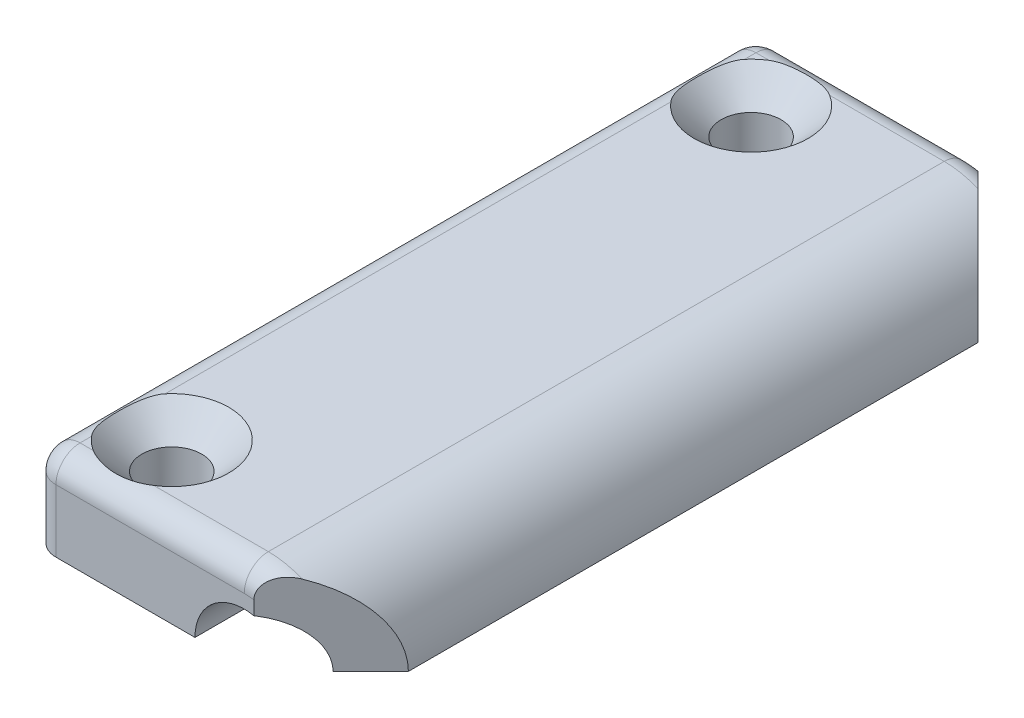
ISO-10303-21;
HEADER;
FILE_DESCRIPTION(('STEP AP214'),'2;1');
FILE_NAME('part.step','',(''),(''),'','','');
FILE_SCHEMA(('AUTOMOTIVE_DESIGN { 1 0 10303 214 1 1 1 1 }'));
ENDSEC;
DATA;
#1=APPLICATION_CONTEXT('core data for automotive mechanical design processes');
#2=APPLICATION_PROTOCOL_DEFINITION('international standard','automotive_design',2000,#1);
#3=PRODUCT_CONTEXT('',#1,'mechanical');
#4=PRODUCT('Part','Part','',(#3));
#5=PRODUCT_RELATED_PRODUCT_CATEGORY('part','',(#4));
#6=PRODUCT_DEFINITION_FORMATION('','',#4);
#7=PRODUCT_DEFINITION_CONTEXT('part definition',#1,'design');
#8=PRODUCT_DEFINITION('design','',#6,#7);
#9=PRODUCT_DEFINITION_SHAPE('','',#8);
#10=(LENGTH_UNIT() NAMED_UNIT(*) SI_UNIT(.MILLI.,.METRE.));
#11=(NAMED_UNIT(*) PLANE_ANGLE_UNIT() SI_UNIT($,.RADIAN.));
#12=(NAMED_UNIT(*) SI_UNIT($,.STERADIAN.) SOLID_ANGLE_UNIT());
#13=UNCERTAINTY_MEASURE_WITH_UNIT(LENGTH_MEASURE(1.E-05),#10,'distance_accuracy_value','');
#14=(GEOMETRIC_REPRESENTATION_CONTEXT(3) GLOBAL_UNCERTAINTY_ASSIGNED_CONTEXT((#13)) GLOBAL_UNIT_ASSIGNED_CONTEXT((#10,
#11,#12)) REPRESENTATION_CONTEXT('',''));
#15=CARTESIAN_POINT('',(0.,0.,0.));
#16=DIRECTION('',(0.,0.,1.));
#17=DIRECTION('',(1.,0.,0.));
#18=AXIS2_PLACEMENT_3D('',#15,#16,#17);
#19=CARTESIAN_POINT('',(7.,4.,15.));
#20=DIRECTION('',(0.,1.,0.));
#21=DIRECTION('',(0.,0.,1.));
#22=AXIS2_PLACEMENT_3D('',#19,#20,#21);
#23=PLANE('',#22);
#24=CARTESIAN_POINT('',(7.,4.,15.));
#25=DIRECTION('',(0.,-1.,0.));
#26=DIRECTION('',(0.,0.,-1.));
#27=AXIS2_PLACEMENT_3D('',#24,#25,#26);
#28=CIRCLE('',#27,3.1);
#29=CARTESIAN_POINT('',(7.,4.,11.9));
#30=VERTEX_POINT('',#29);
#31=EDGE_CURVE('E20',#30,#30,#28,.T.);
#32=ORIENTED_EDGE('',*,*,#31,.T.);
#33=EDGE_LOOP('',(#32));
#34=FACE_BOUND('',#33,.T.);
#35=ADVANCED_FACE('F17',(#34),#23,.F.);
#36=CARTESIAN_POINT('',(7.,4.,-15.));
#37=DIRECTION('',(0.,-1.,0.));
#38=DIRECTION('',(0.,0.,-1.));
#39=AXIS2_PLACEMENT_3D('',#36,#37,#38);
#40=PLANE('',#39);
#41=CARTESIAN_POINT('',(7.,4.,-15.));
#42=DIRECTION('',(0.,-1.,0.));
#43=DIRECTION('',(0.,0.,-1.));
#44=AXIS2_PLACEMENT_3D('',#41,#42,#43);
#45=CIRCLE('',#44,3.1);
#46=CARTESIAN_POINT('',(7.,4.,-18.1));
#47=VERTEX_POINT('',#46);
#48=EDGE_CURVE('E344',#47,#47,#45,.T.);
#49=ORIENTED_EDGE('',*,*,#48,.T.);
#50=EDGE_LOOP('',(#49));
#51=FACE_BOUND('',#50,.T.);
#52=ADVANCED_FACE('F356',(#51),#40,.T.);
#53=CARTESIAN_POINT('',(7.,4.,15.));
#54=DIRECTION('',(0.,-1.,0.));
#55=DIRECTION('',(0.,0.,-1.));
#56=AXIS2_PLACEMENT_3D('',#53,#54,#55);
#57=CYLINDRICAL_SURFACE('',#56,3.1);
#58=ORIENTED_EDGE('',*,*,#31,.F.);
#59=EDGE_LOOP('',(#58));
#60=FACE_BOUND('',#59,.T.);
#61=CARTESIAN_POINT('',(7.,0.,15.));
#62=DIRECTION('',(0.,-1.,0.));
#63=DIRECTION('',(0.,0.,-1.));
#64=AXIS2_PLACEMENT_3D('',#61,#62,#63);
#65=CIRCLE('',#64,3.1);
#66=CARTESIAN_POINT('',(7.,0.,11.9));
#67=VERTEX_POINT('',#66);
#68=EDGE_CURVE('E342',#67,#67,#65,.T.);
#69=ORIENTED_EDGE('',*,*,#68,.T.);
#70=EDGE_LOOP('',(#69));
#71=FACE_BOUND('',#70,.T.);
#72=ADVANCED_FACE('F352',(#60,#71),#57,.F.);
#73=CARTESIAN_POINT('',(7.,4.,-15.));
#74=DIRECTION('',(0.,-1.,0.));
#75=DIRECTION('',(0.,0.,-1.));
#76=AXIS2_PLACEMENT_3D('',#73,#74,#75);
#77=CYLINDRICAL_SURFACE('',#76,3.1);
#78=ORIENTED_EDGE('',*,*,#48,.F.);
#79=EDGE_LOOP('',(#78));
#80=FACE_BOUND('',#79,.T.);
#81=CARTESIAN_POINT('',(7.,0.,-15.));
#82=DIRECTION('',(0.,-1.,0.));
#83=DIRECTION('',(0.,0.,-1.));
#84=AXIS2_PLACEMENT_3D('',#81,#82,#83);
#85=CIRCLE('',#84,3.1);
#86=CARTESIAN_POINT('',(7.,0.,-18.1));
#87=VERTEX_POINT('',#86);
#88=EDGE_CURVE('E145',#87,#87,#85,.T.);
#89=ORIENTED_EDGE('',*,*,#88,.T.);
#90=EDGE_LOOP('',(#89));
#91=FACE_BOUND('',#90,.T.);
#92=ADVANCED_FACE('F355',(#80,#91),#77,.F.);
#93=CARTESIAN_POINT('',(2.5,0.,-35.));
#94=DIRECTION('',(0.,-1.,0.));
#95=DIRECTION('',(0.,0.,-1.));
#96=AXIS2_PLACEMENT_3D('',#93,#94,#95);
#97=CYLINDRICAL_SURFACE('',#96,2.5);
#98=CARTESIAN_POINT('',(2.5,6.50000000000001,-35.));
#99=DIRECTION('',(0.,1.,0.));
#100=DIRECTION('',(1.,0.,0.));
#101=AXIS2_PLACEMENT_3D('',#98,#99,#100);
#102=CIRCLE('',#101,2.5);
#103=CARTESIAN_POINT('',(2.5,6.50000000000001,-37.5));
#104=VERTEX_POINT('',#103);
#105=CARTESIAN_POINT('',(0.,6.50000000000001,-35.));
#106=VERTEX_POINT('',#105);
#107=EDGE_CURVE('E159',#104,#106,#102,.T.);
#108=ORIENTED_EDGE('',*,*,#107,.F.);
#109=DIRECTION('',(0.,1.,0.));
#110=VECTOR('',#109,1.);
#111=CARTESIAN_POINT('',(2.5,0.,-37.5));
#112=LINE('',#111,#110);
#113=CARTESIAN_POINT('',(2.5,0.,-37.5));
#114=VERTEX_POINT('',#113);
#115=EDGE_CURVE('E151',#104,#114,#112,.F.);
#116=ORIENTED_EDGE('',*,*,#115,.T.);
#117=CARTESIAN_POINT('',(2.5,0.,-35.));
#118=DIRECTION('',(0.,-1.,0.));
#119=DIRECTION('',(0.,0.,-1.));
#120=AXIS2_PLACEMENT_3D('',#117,#118,#119);
#121=CIRCLE('',#120,2.5);
#122=CARTESIAN_POINT('',(0.,0.,-35.));
#123=VERTEX_POINT('',#122);
#124=EDGE_CURVE('E133',#114,#123,#121,.F.);
#125=ORIENTED_EDGE('',*,*,#124,.T.);
#126=DIRECTION('',(0.,1.,0.));
#127=VECTOR('',#126,1.);
#128=CARTESIAN_POINT('',(0.,0.,-35.));
#129=LINE('',#128,#127);
#130=EDGE_CURVE('E222',#123,#106,#129,.T.);
#131=ORIENTED_EDGE('',*,*,#130,.T.);
#132=EDGE_LOOP('',(#108,#116,#125,#131));
#133=FACE_BOUND('',#132,.T.);
#134=ADVANCED_FACE('F158',(#133),#97,.T.);
#135=CARTESIAN_POINT('',(0.,0.,37.5));
#136=DIRECTION('',(0.,1.,0.));
#137=DIRECTION('',(0.,0.,1.));
#138=AXIS2_PLACEMENT_3D('',#135,#136,#137);
#139=PLANE('',#138);
#140=CARTESIAN_POINT('',(2.5,0.,35.));
#141=DIRECTION('',(0.,1.,0.));
#142=DIRECTION('',(0.,0.,1.));
#143=AXIS2_PLACEMENT_3D('',#140,#141,#142);
#144=CIRCLE('',#143,2.5);
#145=CARTESIAN_POINT('',(0.,0.,35.));
#146=VERTEX_POINT('',#145);
#147=CARTESIAN_POINT('',(2.5,0.,37.5));
#148=VERTEX_POINT('',#147);
#149=EDGE_CURVE('E211',#146,#148,#144,.T.);
#150=ORIENTED_EDGE('',*,*,#149,.F.);
#151=DIRECTION('',(0.,0.,-1.));
#152=VECTOR('',#151,1.);
#153=CARTESIAN_POINT('',(0.,0.,37.5));
#154=LINE('',#153,#152);
#155=EDGE_CURVE('E140',#146,#123,#154,.T.);
#156=ORIENTED_EDGE('',*,*,#155,.T.);
#157=ORIENTED_EDGE('',*,*,#124,.F.);
#158=DIRECTION('',(1.,0.,0.));
#159=VECTOR('',#158,1.);
#160=CARTESIAN_POINT('',(22.,0.,-37.5));
#161=LINE('',#160,#159);
#162=CARTESIAN_POINT('',(16.9,0.,-37.5));
#163=VERTEX_POINT('',#162);
#164=EDGE_CURVE('E138',#114,#163,#161,.T.);
#165=ORIENTED_EDGE('',*,*,#164,.T.);
#166=DIRECTION('',(0.,0.,-1.));
#167=VECTOR('',#166,1.);
#168=CARTESIAN_POINT('',(16.9,0.,37.5));
#169=LINE('',#168,#167);
#170=CARTESIAN_POINT('',(16.9,0.,37.5));
#171=VERTEX_POINT('',#170);
#172=EDGE_CURVE('E144',#163,#171,#169,.F.);
#173=ORIENTED_EDGE('',*,*,#172,.T.);
#174=DIRECTION('',(1.,0.,0.));
#175=VECTOR('',#174,1.);
#176=CARTESIAN_POINT('',(22.,0.,37.5));
#177=LINE('',#176,#175);
#178=EDGE_CURVE('E274',#148,#171,#177,.T.);
#179=ORIENTED_EDGE('',*,*,#178,.F.);
#180=EDGE_LOOP('',(#150,#156,#157,#165,#173,#179));
#181=FACE_BOUND('',#180,.T.);
#182=CARTESIAN_POINT('',(7.,0.,-30.));
#183=DIRECTION('',(0.,1.,0.));
#184=DIRECTION('',(0.,0.,1.));
#185=AXIS2_PLACEMENT_3D('',#182,#183,#184);
#186=CIRCLE('',#185,3.1);
#187=CARTESIAN_POINT('',(7.,0.,-26.9));
#188=VERTEX_POINT('',#187);
#189=EDGE_CURVE('E161',#188,#188,#186,.T.);
#190=ORIENTED_EDGE('',*,*,#189,.T.);
#191=EDGE_LOOP('',(#190));
#192=FACE_BOUND('',#191,.T.);
#193=CARTESIAN_POINT('',(7.,0.,30.));
#194=DIRECTION('',(0.,1.,0.));
#195=DIRECTION('',(0.,0.,1.));
#196=AXIS2_PLACEMENT_3D('',#193,#194,#195);
#197=CIRCLE('',#196,3.1);
#198=CARTESIAN_POINT('',(7.,0.,33.1));
#199=VERTEX_POINT('',#198);
#200=EDGE_CURVE('E205',#199,#199,#197,.T.);
#201=ORIENTED_EDGE('',*,*,#200,.T.);
#202=EDGE_LOOP('',(#201));
#203=FACE_BOUND('',#202,.T.);
#204=ORIENTED_EDGE('',*,*,#88,.F.);
#205=EDGE_LOOP('',(#204));
#206=FACE_BOUND('',#205,.T.);
#207=ORIENTED_EDGE('',*,*,#68,.F.);
#208=EDGE_LOOP('',(#207));
#209=FACE_BOUND('',#208,.T.);
#210=ADVANCED_FACE('F135',(#181,#192,#203,#206,#209),#139,.F.);
#211=CARTESIAN_POINT('',(22.,0.,37.5));
#212=DIRECTION('',(0.,0.,-1.));
#213=DIRECTION('',(-1.,0.,0.));
#214=AXIS2_PLACEMENT_3D('',#211,#212,#213);
#215=CYLINDRICAL_SURFACE('',#214,5.1);
#216=CARTESIAN_POINT('',(22.,0.,38.5));
#217=DIRECTION('',(-0.707106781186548,0.,-0.707106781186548));
#218=DIRECTION('',(0.707106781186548,0.,-0.707106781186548));
#219=AXIS2_PLACEMENT_3D('',#216,#217,#218);
#220=ELLIPSE('',#219,7.21248916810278,5.1);
#221=CARTESIAN_POINT('',(27.1,0.,33.4));
#222=VERTEX_POINT('',#221);
#223=CARTESIAN_POINT('',(23.,5.00099990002,37.5));
#224=VERTEX_POINT('',#223);
#225=EDGE_CURVE('E173',#222,#224,#220,.F.);
#226=ORIENTED_EDGE('',*,*,#225,.T.);
#227=CARTESIAN_POINT('',(22.,0.,37.5));
#228=DIRECTION('',(0.,0.,-1.));
#229=DIRECTION('',(-1.,0.,0.));
#230=AXIS2_PLACEMENT_3D('',#227,#228,#229);
#231=CIRCLE('',#230,5.1);
#232=EDGE_CURVE('E281',#171,#224,#231,.T.);
#233=ORIENTED_EDGE('',*,*,#232,.F.);
#234=ORIENTED_EDGE('',*,*,#172,.F.);
#235=CARTESIAN_POINT('',(22.,0.,-37.5));
#236=DIRECTION('',(0.,0.,-1.));
#237=DIRECTION('',(-1.,0.,0.));
#238=AXIS2_PLACEMENT_3D('',#235,#236,#237);
#239=CIRCLE('',#238,5.1);
#240=CARTESIAN_POINT('',(23.,5.00099990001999,-37.5));
#241=VERTEX_POINT('',#240);
#242=EDGE_CURVE('E155',#163,#241,#239,.T.);
#243=ORIENTED_EDGE('',*,*,#242,.T.);
#244=CARTESIAN_POINT('',(22.,0.,-38.5));
#245=DIRECTION('',(0.707106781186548,0.,-0.707106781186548));
#246=DIRECTION('',(-0.707106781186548,0.,-0.707106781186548));
#247=AXIS2_PLACEMENT_3D('',#244,#245,#246);
#248=ELLIPSE('',#247,7.21248916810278,5.1);
#249=CARTESIAN_POINT('',(27.1,0.,-33.4));
#250=VERTEX_POINT('',#249);
#251=EDGE_CURVE('E330',#250,#241,#248,.F.);
#252=ORIENTED_EDGE('',*,*,#251,.F.);
#253=DIRECTION('',(0.,0.,1.));
#254=VECTOR('',#253,1.);
#255=CARTESIAN_POINT('',(27.1,0.,37.5));
#256=LINE('',#255,#254);
#257=EDGE_CURVE('E335',#250,#222,#256,.T.);
#258=ORIENTED_EDGE('',*,*,#257,.T.);
#259=EDGE_LOOP('',(#226,#233,#234,#243,#252,#258));
#260=FACE_BOUND('',#259,.T.);
#261=ADVANCED_FACE('F361',(#260),#215,.F.);
#262=CARTESIAN_POINT('',(2.5,0.,35.));
#263=DIRECTION('',(0.,1.,0.));
#264=DIRECTION('',(0.,0.,1.));
#265=AXIS2_PLACEMENT_3D('',#262,#263,#264);
#266=CYLINDRICAL_SURFACE('',#265,2.5);
#267=CARTESIAN_POINT('',(2.5,6.5,35.));
#268=DIRECTION('',(0.,-1.,0.));
#269=DIRECTION('',(1.,0.,0.));
#270=AXIS2_PLACEMENT_3D('',#267,#268,#269);
#271=CIRCLE('',#270,2.5);
#272=CARTESIAN_POINT('',(0.,6.5,35.));
#273=VERTEX_POINT('',#272);
#274=CARTESIAN_POINT('',(2.5,6.50000000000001,37.5));
#275=VERTEX_POINT('',#274);
#276=EDGE_CURVE('E299',#273,#275,#271,.F.);
#277=ORIENTED_EDGE('',*,*,#276,.F.);
#278=DIRECTION('',(0.,1.,0.));
#279=VECTOR('',#278,1.);
#280=CARTESIAN_POINT('',(0.,0.,35.));
#281=LINE('',#280,#279);
#282=EDGE_CURVE('E219',#273,#146,#281,.F.);
#283=ORIENTED_EDGE('',*,*,#282,.T.);
#284=ORIENTED_EDGE('',*,*,#149,.T.);
#285=DIRECTION('',(0.,1.,0.));
#286=VECTOR('',#285,1.);
#287=CARTESIAN_POINT('',(2.5,0.,37.5));
#288=LINE('',#287,#286);
#289=EDGE_CURVE('E282',#275,#148,#288,.F.);
#290=ORIENTED_EDGE('',*,*,#289,.F.);
#291=EDGE_LOOP('',(#277,#283,#284,#290));
#292=FACE_BOUND('',#291,.T.);
#293=ADVANCED_FACE('F368',(#292),#266,.T.);
#294=CARTESIAN_POINT('',(0.,9.00000000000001,37.5));
#295=DIRECTION('',(0.,-1.,0.));
#296=DIRECTION('',(0.,0.,-1.));
#297=AXIS2_PLACEMENT_3D('',#294,#295,#296);
#298=PLANE('',#297);
#299=DIRECTION('',(0.,0.,-1.));
#300=VECTOR('',#299,1.);
#301=CARTESIAN_POINT('',(2.5,9.00000000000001,37.5));
#302=LINE('',#301,#300);
#303=CARTESIAN_POINT('',(2.5,9.00000000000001,35.));
#304=VERTEX_POINT('',#303);
#305=CARTESIAN_POINT('',(2.5,8.99999999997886,33.8157568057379));
#306=VERTEX_POINT('',#305);
#307=EDGE_CURVE('E203',#304,#306,#302,.T.);
#308=ORIENTED_EDGE('',*,*,#307,.F.);
#309=DIRECTION('',(1.,0.,0.));
#310=VECTOR('',#309,1.);
#311=CARTESIAN_POINT('',(0.,9.00000000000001,35.));
#312=LINE('',#311,#310);
#313=CARTESIAN_POINT('',(3.86790804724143,8.99999999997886,35.));
#314=VERTEX_POINT('',#313);
#315=EDGE_CURVE('E206',#314,#304,#312,.F.);
#316=ORIENTED_EDGE('',*,*,#315,.F.);
#317=CARTESIAN_POINT('',(7.,8.99999999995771,30.));
#318=DIRECTION('',(0.,1.,0.));
#319=DIRECTION('',(0.,0.,1.));
#320=AXIS2_PLACEMENT_3D('',#317,#318,#319);
#321=CIRCLE('',#320,5.90000000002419);
#322=EDGE_CURVE('E202',#314,#306,#321,.F.);
#323=ORIENTED_EDGE('',*,*,#322,.T.);
#324=EDGE_LOOP('',(#308,#316,#323));
#325=FACE_BOUND('',#324,.T.);
#326=ADVANCED_FACE('F550',(#325),#298,.F.);
#327=CARTESIAN_POINT('',(7.,0.,30.));
#328=DIRECTION('',(0.,1.,0.));
#329=DIRECTION('',(0.,0.,1.));
#330=AXIS2_PLACEMENT_3D('',#327,#328,#329);
#331=CYLINDRICAL_SURFACE('',#330,3.1);
#332=CARTESIAN_POINT('',(7.,6.19999999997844,30.));
#333=DIRECTION('',(0.,1.,0.));
#334=DIRECTION('',(0.,0.,-1.));
#335=AXIS2_PLACEMENT_3D('',#332,#333,#334);
#336=CIRCLE('',#335,3.10000000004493);
#337=CARTESIAN_POINT('',(7.,6.19999999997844,26.8999999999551));
#338=VERTEX_POINT('',#337);
#339=EDGE_CURVE('E199',#338,#338,#336,.T.);
#340=ORIENTED_EDGE('',*,*,#339,.T.);
#341=EDGE_LOOP('',(#340));
#342=FACE_BOUND('',#341,.T.);
#343=ORIENTED_EDGE('',*,*,#200,.F.);
#344=EDGE_LOOP('',(#343));
#345=FACE_BOUND('',#344,.T.);
#346=ADVANCED_FACE('F606',(#342,#345),#331,.F.);
#347=CARTESIAN_POINT('',(0.,0.,37.5));
#348=DIRECTION('',(1.,0.,0.));
#349=DIRECTION('',(0.,0.,-1.));
#350=AXIS2_PLACEMENT_3D('',#347,#348,#349);
#351=PLANE('',#350);
#352=ORIENTED_EDGE('',*,*,#282,.F.);
#353=DIRECTION('',(0.,0.,-1.));
#354=VECTOR('',#353,1.);
#355=CARTESIAN_POINT('',(0.,6.50000000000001,37.5));
#356=LINE('',#355,#354);
#357=EDGE_CURVE('E195',#106,#273,#356,.F.);
#358=ORIENTED_EDGE('',*,*,#357,.F.);
#359=ORIENTED_EDGE('',*,*,#130,.F.);
#360=ORIENTED_EDGE('',*,*,#155,.F.);
#361=EDGE_LOOP('',(#352,#358,#359,#360));
#362=FACE_BOUND('',#361,.T.);
#363=ADVANCED_FACE('F599',(#362),#351,.F.);
#364=CARTESIAN_POINT('',(0.,9.00000000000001,37.5));
#365=DIRECTION('',(0.,-1.,0.));
#366=DIRECTION('',(0.,0.,-1.));
#367=AXIS2_PLACEMENT_3D('',#364,#365,#366);
#368=PLANE('',#367);
#369=DIRECTION('',(0.,0.,-1.));
#370=VECTOR('',#369,1.);
#371=CARTESIAN_POINT('',(2.5,9.00000000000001,37.5));
#372=LINE('',#371,#370);
#373=CARTESIAN_POINT('',(2.5,8.99999999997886,-33.8157568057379));
#374=VERTEX_POINT('',#373);
#375=CARTESIAN_POINT('',(2.5,9.00000000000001,-34.9999999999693));
#376=VERTEX_POINT('',#375);
#377=EDGE_CURVE('E196',#374,#376,#372,.T.);
#378=ORIENTED_EDGE('',*,*,#377,.F.);
#379=CARTESIAN_POINT('',(7.,8.99999999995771,-30.));
#380=DIRECTION('',(0.,1.,0.));
#381=DIRECTION('',(0.,0.,1.));
#382=AXIS2_PLACEMENT_3D('',#379,#380,#381);
#383=CIRCLE('',#382,5.90000000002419);
#384=CARTESIAN_POINT('',(3.86790804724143,8.99999999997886,-35.));
#385=VERTEX_POINT('',#384);
#386=EDGE_CURVE('E187',#374,#385,#383,.F.);
#387=ORIENTED_EDGE('',*,*,#386,.T.);
#388=DIRECTION('',(1.,0.,0.));
#389=VECTOR('',#388,1.);
#390=CARTESIAN_POINT('',(0.,9.00000000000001,-35.));
#391=LINE('',#390,#389);
#392=EDGE_CURVE('E164',#376,#385,#391,.T.);
#393=ORIENTED_EDGE('',*,*,#392,.F.);
#394=EDGE_LOOP('',(#378,#387,#393));
#395=FACE_BOUND('',#394,.T.);
#396=ADVANCED_FACE('F479',(#395),#368,.F.);
#397=CARTESIAN_POINT('',(7.,0.,-30.));
#398=DIRECTION('',(0.,1.,0.));
#399=DIRECTION('',(0.,0.,1.));
#400=AXIS2_PLACEMENT_3D('',#397,#398,#399);
#401=CYLINDRICAL_SURFACE('',#400,3.1);
#402=ORIENTED_EDGE('',*,*,#189,.F.);
#403=EDGE_LOOP('',(#402));
#404=FACE_BOUND('',#403,.T.);
#405=CARTESIAN_POINT('',(7.,6.19999999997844,-30.));
#406=DIRECTION('',(0.,1.,0.));
#407=DIRECTION('',(0.,0.,1.));
#408=AXIS2_PLACEMENT_3D('',#405,#406,#407);
#409=CIRCLE('',#408,3.10000000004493);
#410=CARTESIAN_POINT('',(7.,6.19999999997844,-26.8999999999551));
#411=VERTEX_POINT('',#410);
#412=EDGE_CURVE('E183',#411,#411,#409,.T.);
#413=ORIENTED_EDGE('',*,*,#412,.T.);
#414=EDGE_LOOP('',(#413));
#415=FACE_BOUND('',#414,.T.);
#416=ADVANCED_FACE('F587',(#404,#415),#401,.F.);
#417=CARTESIAN_POINT('',(22.,0.,-37.5));
#418=DIRECTION('',(0.,0.,1.));
#419=DIRECTION('',(1.,0.,0.));
#420=AXIS2_PLACEMENT_3D('',#417,#418,#419);
#421=PLANE('',#420);
#422=ORIENTED_EDGE('',*,*,#242,.F.);
#423=ORIENTED_EDGE('',*,*,#164,.F.);
#424=ORIENTED_EDGE('',*,*,#115,.F.);
#425=DIRECTION('',(-1.,0.,0.));
#426=VECTOR('',#425,1.);
#427=CARTESIAN_POINT('',(0.,6.50000000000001,-37.5));
#428=LINE('',#427,#426);
#429=CARTESIAN_POINT('',(22.,6.50000000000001,-37.5));
#430=VERTEX_POINT('',#429);
#431=EDGE_CURVE('E180',#430,#104,#428,.T.);
#432=ORIENTED_EDGE('',*,*,#431,.F.);
#433=CARTESIAN_POINT('',(22.,0.,-37.5));
#434=DIRECTION('',(0.,0.,1.));
#435=DIRECTION('',(0.153846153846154,0.988094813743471,0.));
#436=AXIS2_PLACEMENT_3D('',#433,#434,#435);
#437=CIRCLE('',#436,6.5);
#438=CARTESIAN_POINT('',(23.,6.42261628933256,-37.5));
#439=VERTEX_POINT('',#438);
#440=EDGE_CURVE('E285',#439,#430,#437,.T.);
#441=ORIENTED_EDGE('',*,*,#440,.F.);
#442=DIRECTION('',(0.,1.,0.));
#443=VECTOR('',#442,1.);
#444=CARTESIAN_POINT('',(23.,20.3137084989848,-37.5));
#445=LINE('',#444,#443);
#446=EDGE_CURVE('E332',#241,#439,#445,.T.);
#447=ORIENTED_EDGE('',*,*,#446,.F.);
#448=EDGE_LOOP('',(#422,#423,#424,#432,#441,#447));
#449=FACE_BOUND('',#448,.T.);
#450=ADVANCED_FACE('F149',(#449),#421,.F.);
#451=CARTESIAN_POINT('',(2.5,6.50000000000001,-35.));
#452=DIRECTION('',(1.,0.,0.));
#453=DIRECTION('',(0.,0.,-1.));
#454=AXIS2_PLACEMENT_3D('',#451,#452,#453);
#455=SPHERICAL_SURFACE('',#454,2.5);
#456=ORIENTED_EDGE('',*,*,#107,.T.);
#457=CARTESIAN_POINT('',(2.5,6.50000000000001,-35.));
#458=DIRECTION('',(0.,0.,-1.));
#459=DIRECTION('',(-1.,0.,0.));
#460=AXIS2_PLACEMENT_3D('',#457,#458,#459);
#461=CIRCLE('',#460,2.5);
#462=EDGE_CURVE('E192',#376,#106,#461,.F.);
#463=ORIENTED_EDGE('',*,*,#462,.F.);
#464=CARTESIAN_POINT('',(2.5,6.50000000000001,-35.));
#465=DIRECTION('',(-1.,0.,0.));
#466=DIRECTION('',(0.,0.,1.));
#467=AXIS2_PLACEMENT_3D('',#464,#465,#466);
#468=CIRCLE('',#467,2.5);
#469=EDGE_CURVE('E176',#104,#376,#468,.F.);
#470=ORIENTED_EDGE('',*,*,#469,.F.);
#471=EDGE_LOOP('',(#456,#463,#470));
#472=FACE_BOUND('',#471,.T.);
#473=ADVANCED_FACE('F435',(#472),#455,.T.);
#474=CARTESIAN_POINT('',(23.,20.3137084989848,37.5));
#475=DIRECTION('',(-0.707106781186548,0.,-0.707106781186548));
#476=DIRECTION('',(-0.707106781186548,0.,0.707106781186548));
#477=AXIS2_PLACEMENT_3D('',#474,#475,#476);
#478=PLANE('',#477);
#479=CARTESIAN_POINT('',(22.,0.,38.5));
#480=DIRECTION('',(-0.707106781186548,0.,-0.707106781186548));
#481=DIRECTION('',(0.707106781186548,0.,-0.707106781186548));
#482=AXIS2_PLACEMENT_3D('',#479,#480,#481);
#483=ELLIPSE('',#482,12.7279220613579,9.);
#484=CARTESIAN_POINT('',(25.5,8.2915619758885,35.));
#485=VERTEX_POINT('',#484);
#486=CARTESIAN_POINT('',(31.,0.,29.5));
#487=VERTEX_POINT('',#486);
#488=EDGE_CURVE('E486',#485,#487,#483,.T.);
#489=ORIENTED_EDGE('',*,*,#488,.F.);
#490=CARTESIAN_POINT('',(23.,6.42261628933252,37.5));
#491=CARTESIAN_POINT('',(22.9999889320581,6.4741114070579,37.5000110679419));
#492=CARTESIAN_POINT('',(23.001553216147,6.52561094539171,37.498446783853));
#493=CARTESIAN_POINT('',(23.0078451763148,6.62821871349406,37.4921548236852));
#494=CARTESIAN_POINT('',(23.012572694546,6.67932696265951,37.487427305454));
#495=CARTESIAN_POINT('',(23.0251768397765,6.78054066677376,37.4748231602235));
#496=CARTESIAN_POINT('',(23.033039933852,6.8306494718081,37.466960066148));
#497=CARTESIAN_POINT('',(23.0518390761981,6.92968262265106,37.4481609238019));
#498=CARTESIAN_POINT('',(23.0627749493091,6.97860703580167,37.4372250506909));
#499=CARTESIAN_POINT('',(23.1000476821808,7.12310149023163,37.3999523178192));
#500=CARTESIAN_POINT('',(23.1308558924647,7.21644213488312,37.3691441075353));
#501=CARTESIAN_POINT('',(23.2029348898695,7.39458963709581,37.2970651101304));
#502=CARTESIAN_POINT('',(23.2442118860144,7.47939138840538,37.2557881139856));
#503=CARTESIAN_POINT('',(23.3362001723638,7.64020788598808,37.1637998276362));
#504=CARTESIAN_POINT('',(23.3870486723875,7.71606480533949,37.1129513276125));
#505=CARTESIAN_POINT('',(23.4959321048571,7.85659814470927,37.0040678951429));
#506=CARTESIAN_POINT('',(23.5539702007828,7.92126961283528,36.9460297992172));
#507=CARTESIAN_POINT('',(23.6851251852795,8.04836759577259,36.8148748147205));
#508=CARTESIAN_POINT('',(23.7591798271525,8.10885451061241,36.7408201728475));
#509=CARTESIAN_POINT('',(23.9125130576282,8.21456574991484,36.5874869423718));
#510=CARTESIAN_POINT('',(23.9917939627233,8.25978325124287,36.5082060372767));
#511=CARTESIAN_POINT('',(24.169120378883,8.34256919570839,36.330879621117));
#512=CARTESIAN_POINT('',(24.2678800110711,8.37707587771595,36.2321199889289));
#513=CARTESIAN_POINT('',(24.4678525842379,8.42625634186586,36.0321474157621));
#514=CARTESIAN_POINT('',(24.5690677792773,8.4409111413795,35.9309322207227));
#515=CARTESIAN_POINT('',(24.7913994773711,8.4526248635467,35.7086005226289));
#516=CARTESIAN_POINT('',(24.9126174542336,8.44577941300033,35.5873825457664));
#517=CARTESIAN_POINT('',(25.1529856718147,8.40785918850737,35.3470143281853));
#518=CARTESIAN_POINT('',(25.2721376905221,8.37680642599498,35.2278623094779));
#519=CARTESIAN_POINT('',(25.4263715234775,8.3214788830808,35.0736284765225));
#520=CARTESIAN_POINT('',(25.4633067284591,8.30705301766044,35.0366932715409));
#521=CARTESIAN_POINT('',(25.5,8.2915619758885,35.));
#522=B_SPLINE_CURVE_WITH_KNOTS('',3,(#490,#491,#492,#493,#494,#495,#496,#497,#498,#499,#500,
#501,#502,#503,#504,#505,#506,#507,#508,#509,#510,#511,#512,#513,#514,#515,#516,#517,#518,#519,
#520,#521),.UNSPECIFIED.,.F.,.F.,(4,2,2,2,2,2,2,2,2,2,2,2,2,2,2,4),(0.,0.154442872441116,
0.308878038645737,0.462653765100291,0.616420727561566,0.923806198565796,1.23137440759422,
1.54374370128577,1.85625093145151,2.21772547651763,2.57936133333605,3.00935915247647,
3.43976785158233,3.95255045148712,4.46486732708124,4.6273795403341),.UNSPECIFIED.);
#523=CARTESIAN_POINT('',(23.,6.42261628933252,37.5));
#524=VERTEX_POINT('',#523);
#525=EDGE_CURVE('E422',#524,#485,#522,.T.);
#526=ORIENTED_EDGE('',*,*,#525,.F.);
#527=DIRECTION('',(0.,1.,0.));
#528=VECTOR('',#527,1.);
#529=CARTESIAN_POINT('',(23.,0.,37.5));
#530=LINE('',#529,#528);
#531=EDGE_CURVE('E283',#224,#524,#530,.T.);
#532=ORIENTED_EDGE('',*,*,#531,.F.);
#533=ORIENTED_EDGE('',*,*,#225,.F.);
#534=DIRECTION('',(0.707106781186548,0.,-0.707106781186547));
#535=VECTOR('',#534,1.);
#536=CARTESIAN_POINT('',(27.1,0.,33.4));
#537=LINE('',#536,#535);
#538=EDGE_CURVE('E333',#222,#487,#537,.T.);
#539=ORIENTED_EDGE('',*,*,#538,.T.);
#540=EDGE_LOOP('',(#489,#526,#532,#533,#539));
#541=FACE_BOUND('',#540,.T.);
#542=ADVANCED_FACE('F430',(#541),#478,.F.);
#543=CARTESIAN_POINT('',(27.1,0.,37.5));
#544=DIRECTION('',(0.,1.,0.));
#545=DIRECTION('',(-1.,0.,0.));
#546=AXIS2_PLACEMENT_3D('',#543,#544,#545);
#547=PLANE('',#546);
#548=ORIENTED_EDGE('',*,*,#538,.F.);
#549=ORIENTED_EDGE('',*,*,#257,.F.);
#550=DIRECTION('',(-0.707106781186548,0.,-0.707106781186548));
#551=VECTOR('',#550,1.);
#552=CARTESIAN_POINT('',(23.,0.,-37.5));
#553=LINE('',#552,#551);
#554=CARTESIAN_POINT('',(31.,0.,-29.5));
#555=VERTEX_POINT('',#554);
#556=EDGE_CURVE('E305',#555,#250,#553,.T.);
#557=ORIENTED_EDGE('',*,*,#556,.F.);
#558=DIRECTION('',(0.,0.,-1.));
#559=VECTOR('',#558,1.);
#560=CARTESIAN_POINT('',(31.,0.,37.5));
#561=LINE('',#560,#559);
#562=EDGE_CURVE('E463',#487,#555,#561,.T.);
#563=ORIENTED_EDGE('',*,*,#562,.F.);
#564=EDGE_LOOP('',(#548,#549,#557,#563));
#565=FACE_BOUND('',#564,.T.);
#566=ADVANCED_FACE('F434',(#565),#547,.F.);
#567=CARTESIAN_POINT('',(23.,20.3137084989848,-37.5));
#568=DIRECTION('',(0.707106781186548,0.,-0.707106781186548));
#569=DIRECTION('',(-0.707106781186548,0.,-0.707106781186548));
#570=AXIS2_PLACEMENT_3D('',#567,#568,#569);
#571=PLANE('',#570);
#572=CARTESIAN_POINT('',(22.,0.,-38.5));
#573=DIRECTION('',(0.707106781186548,0.,-0.707106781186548));
#574=DIRECTION('',(-0.707106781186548,0.,-0.707106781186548));
#575=AXIS2_PLACEMENT_3D('',#572,#573,#574);
#576=ELLIPSE('',#575,12.7279220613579,9.);
#577=CARTESIAN_POINT('',(25.5,8.2915619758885,-35.));
#578=VERTEX_POINT('',#577);
#579=EDGE_CURVE('E395',#555,#578,#576,.F.);
#580=ORIENTED_EDGE('',*,*,#579,.F.);
#581=ORIENTED_EDGE('',*,*,#556,.T.);
#582=ORIENTED_EDGE('',*,*,#251,.T.);
#583=ORIENTED_EDGE('',*,*,#446,.T.);
#584=CARTESIAN_POINT('',(25.5,8.2915619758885,-35.));
#585=CARTESIAN_POINT('',(25.4282685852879,8.32182772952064,-35.0717314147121));
#586=CARTESIAN_POINT('',(25.3557116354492,8.34801576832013,-35.1442883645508));
#587=CARTESIAN_POINT('',(25.2092084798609,8.39174016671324,-35.2907915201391));
#588=CARTESIAN_POINT('',(25.1352605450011,8.40926490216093,-35.3647394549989));
#589=CARTESIAN_POINT('',(24.9112572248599,8.44812316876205,-35.5887427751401));
#590=CARTESIAN_POINT('',(24.7597824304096,8.45542020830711,-35.7402175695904));
#591=CARTESIAN_POINT('',(24.4947692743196,8.4315949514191,-36.0052307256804));
#592=CARTESIAN_POINT('',(24.3808085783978,8.40923002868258,-36.1191914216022));
#593=CARTESIAN_POINT('',(24.1571290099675,8.33867814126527,-36.3428709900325));
#594=CARTESIAN_POINT('',(24.0473986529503,8.29056727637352,-36.4526013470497));
#595=CARTESIAN_POINT('',(23.8549049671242,8.17833129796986,-36.6450950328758));
#596=CARTESIAN_POINT('',(23.7708453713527,8.11865427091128,-36.7291546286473));
#597=CARTESIAN_POINT('',(23.610675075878,7.98064369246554,-36.889324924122));
#598=CARTESIAN_POINT('',(23.5345598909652,7.90232075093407,-36.9654401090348));
#599=CARTESIAN_POINT('',(23.4051119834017,7.74177865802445,-37.0948880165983));
#600=CARTESIAN_POINT('',(23.3500887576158,7.66228605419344,-37.1499112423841));
#601=CARTESIAN_POINT('',(23.2500668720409,7.49141433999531,-37.2499331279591));
#602=CARTESIAN_POINT('',(23.2050630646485,7.4000413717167,-37.2949369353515));
#603=CARTESIAN_POINT('',(23.1466318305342,7.25533413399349,-37.3533681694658));
#604=CARTESIAN_POINT('',(23.1286162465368,7.2056202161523,-37.3713837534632));
#605=CARTESIAN_POINT('',(23.0959247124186,7.10405180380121,-37.4040752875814));
#606=CARTESIAN_POINT('',(23.0812471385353,7.05219836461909,-37.4187528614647));
#607=CARTESIAN_POINT('',(23.0554430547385,6.94680499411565,-37.4445569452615));
#608=CARTESIAN_POINT('',(23.0443135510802,6.89326652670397,-37.4556864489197));
#609=CARTESIAN_POINT('',(23.0257279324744,6.78495357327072,-37.4742720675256));
#610=CARTESIAN_POINT('',(23.0182698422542,6.7301797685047,-37.4817301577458));
#611=CARTESIAN_POINT('',(23.0084298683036,6.63321080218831,-37.4915701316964));
#612=CARTESIAN_POINT('',(23.0052570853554,6.59117212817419,-37.4947429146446));
#613=CARTESIAN_POINT('',(23.0010419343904,6.506961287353,-37.4989580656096));
#614=CARTESIAN_POINT('',(22.9999955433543,6.46478952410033,-37.5000044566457));
#615=CARTESIAN_POINT('',(23.,6.42261628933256,-37.5));
#616=B_SPLINE_CURVE_WITH_KNOTS('',3,(#584,#585,#586,#587,#588,#589,#590,#591,#592,#593,#594,
#595,#596,#597,#598,#599,#600,#601,#602,#603,#604,#605,#606,#607,#608,#609,#610,#611,#612,#613,
#614,#615),.UNSPECIFIED.,.F.,.F.,(4,2,2,2,2,2,2,2,2,2,2,2,2,2,2,4),(0.,0.31738894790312,
0.635202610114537,1.27407237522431,1.76039918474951,2.24529638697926,2.6428142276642,
3.04010641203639,3.37249831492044,3.70471905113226,3.87210568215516,4.03941071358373,
4.20657420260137,4.37364765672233,4.50037650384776,4.62686536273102),.UNSPECIFIED.);
#617=EDGE_CURVE('E328',#578,#439,#616,.T.);
#618=ORIENTED_EDGE('',*,*,#617,.F.);
#619=EDGE_LOOP('',(#580,#581,#582,#583,#618));
#620=FACE_BOUND('',#619,.T.);
#621=ADVANCED_FACE('F311',(#620),#571,.T.);
#622=CARTESIAN_POINT('',(22.,0.,-35.));
#623=DIRECTION('',(0.,0.,1.));
#624=DIRECTION('',(1.,0.,0.));
#625=AXIS2_PLACEMENT_3D('',#622,#623,#624);
#626=TOROIDAL_SURFACE('',#625,6.5,2.5);
#627=ORIENTED_EDGE('',*,*,#440,.T.);
#628=CARTESIAN_POINT('',(22.,6.50000000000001,-35.));
#629=DIRECTION('',(-1.,0.,0.));
#630=DIRECTION('',(0.,0.,1.));
#631=AXIS2_PLACEMENT_3D('',#628,#629,#630);
#632=CIRCLE('',#631,2.5);
#633=CARTESIAN_POINT('',(22.,9.00000000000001,-35.));
#634=VERTEX_POINT('',#633);
#635=EDGE_CURVE('E186',#634,#430,#632,.T.);
#636=ORIENTED_EDGE('',*,*,#635,.F.);
#637=CARTESIAN_POINT('',(22.,0.,-35.));
#638=DIRECTION('',(0.,0.,-1.));
#639=DIRECTION('',(-1.,0.,0.));
#640=AXIS2_PLACEMENT_3D('',#637,#638,#639);
#641=CIRCLE('',#640,9.);
#642=EDGE_CURVE('E523',#578,#634,#641,.F.);
#643=ORIENTED_EDGE('',*,*,#642,.F.);
#644=ORIENTED_EDGE('',*,*,#617,.T.);
#645=EDGE_LOOP('',(#627,#636,#643,#644));
#646=FACE_BOUND('',#645,.T.);
#647=ADVANCED_FACE('F307',(#646),#626,.T.);
#648=CARTESIAN_POINT('',(22.,0.,37.5));
#649=DIRECTION('',(0.,0.,1.));
#650=DIRECTION('',(1.,0.,0.));
#651=AXIS2_PLACEMENT_3D('',#648,#649,#650);
#652=PLANE('',#651);
#653=ORIENTED_EDGE('',*,*,#178,.T.);
#654=ORIENTED_EDGE('',*,*,#232,.T.);
#655=ORIENTED_EDGE('',*,*,#531,.T.);
#656=CARTESIAN_POINT('',(22.,0.,37.5));
#657=DIRECTION('',(0.,0.,-1.));
#658=DIRECTION('',(0.,1.,0.));
#659=AXIS2_PLACEMENT_3D('',#656,#657,#658);
#660=CIRCLE('',#659,6.5);
#661=CARTESIAN_POINT('',(22.,6.50000000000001,37.5));
#662=VERTEX_POINT('',#661);
#663=EDGE_CURVE('E234',#662,#524,#660,.T.);
#664=ORIENTED_EDGE('',*,*,#663,.F.);
#665=DIRECTION('',(1.,0.,0.));
#666=VECTOR('',#665,1.);
#667=CARTESIAN_POINT('',(22.,6.50000000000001,37.5));
#668=LINE('',#667,#666);
#669=EDGE_CURVE('E263',#275,#662,#668,.T.);
#670=ORIENTED_EDGE('',*,*,#669,.F.);
#671=ORIENTED_EDGE('',*,*,#289,.T.);
#672=EDGE_LOOP('',(#653,#654,#655,#664,#670,#671));
#673=FACE_BOUND('',#672,.T.);
#674=ADVANCED_FACE('F253',(#673),#652,.T.);
#675=CARTESIAN_POINT('',(22.,0.,35.));
#676=DIRECTION('',(0.,0.,1.));
#677=DIRECTION('',(1.,0.,0.));
#678=AXIS2_PLACEMENT_3D('',#675,#676,#677);
#679=TOROIDAL_SURFACE('',#678,6.5,2.5);
#680=CARTESIAN_POINT('',(22.,6.50000000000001,35.));
#681=DIRECTION('',(1.,0.,0.));
#682=DIRECTION('',(0.,0.,-1.));
#683=AXIS2_PLACEMENT_3D('',#680,#681,#682);
#684=CIRCLE('',#683,2.5);
#685=CARTESIAN_POINT('',(22.,9.00000000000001,35.));
#686=VERTEX_POINT('',#685);
#687=EDGE_CURVE('E34',#662,#686,#684,.F.);
#688=ORIENTED_EDGE('',*,*,#687,.F.);
#689=ORIENTED_EDGE('',*,*,#663,.T.);
#690=ORIENTED_EDGE('',*,*,#525,.T.);
#691=CARTESIAN_POINT('',(22.,0.,35.));
#692=DIRECTION('',(0.,0.,-1.));
#693=DIRECTION('',(-1.,0.,0.));
#694=AXIS2_PLACEMENT_3D('',#691,#692,#693);
#695=CIRCLE('',#694,9.);
#696=EDGE_CURVE('E265',#686,#485,#695,.T.);
#697=ORIENTED_EDGE('',*,*,#696,.F.);
#698=EDGE_LOOP('',(#688,#689,#690,#697));
#699=FACE_BOUND('',#698,.T.);
#700=ADVANCED_FACE('F241',(#699),#679,.T.);
#701=CARTESIAN_POINT('',(2.5,6.50000000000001,35.));
#702=DIRECTION('',(1.,0.,0.));
#703=DIRECTION('',(0.,0.,-1.));
#704=AXIS2_PLACEMENT_3D('',#701,#702,#703);
#705=SPHERICAL_SURFACE('',#704,2.5);
#706=CARTESIAN_POINT('',(2.5,6.50000000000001,35.));
#707=DIRECTION('',(1.,0.,0.));
#708=DIRECTION('',(0.,0.,-1.));
#709=AXIS2_PLACEMENT_3D('',#706,#707,#708);
#710=CIRCLE('',#709,2.5);
#711=EDGE_CURVE('E292',#304,#275,#710,.T.);
#712=ORIENTED_EDGE('',*,*,#711,.F.);
#713=CARTESIAN_POINT('',(2.5,6.50000000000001,35.));
#714=DIRECTION('',(0.,0.,-1.));
#715=DIRECTION('',(-1.,0.,0.));
#716=AXIS2_PLACEMENT_3D('',#713,#714,#715);
#717=CIRCLE('',#716,2.5);
#718=EDGE_CURVE('E216',#273,#304,#717,.T.);
#719=ORIENTED_EDGE('',*,*,#718,.F.);
#720=ORIENTED_EDGE('',*,*,#276,.T.);
#721=EDGE_LOOP('',(#712,#719,#720));
#722=FACE_BOUND('',#721,.T.);
#723=ADVANCED_FACE('F252',(#722),#705,.T.);
#724=CARTESIAN_POINT('',(7.,8.99999999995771,30.));
#725=DIRECTION('',(0.,1.,0.));
#726=DIRECTION('',(0.,0.,1.));
#727=AXIS2_PLACEMENT_3D('',#724,#725,#726);
#728=CONICAL_SURFACE('',#727,5.90000000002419,0.785398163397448);
#729=ORIENTED_EDGE('',*,*,#339,.F.);
#730=EDGE_LOOP('',(#729));
#731=FACE_BOUND('',#730,.T.);
#732=CARTESIAN_POINT('',(7.,8.99999999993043,30.));
#733=DIRECTION('',(0.,1.,0.));
#734=DIRECTION('',(0.,0.,1.));
#735=AXIS2_PLACEMENT_3D('',#732,#733,#734);
#736=CIRCLE('',#735,5.89999999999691);
#737=CARTESIAN_POINT('',(10.1320919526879,8.99999999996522,35.0000000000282));
#738=VERTEX_POINT('',#737);
#739=CARTESIAN_POINT('',(2.49999999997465,8.99999999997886,26.184243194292));
#740=VERTEX_POINT('',#739);
#741=EDGE_CURVE('E295',#738,#740,#736,.T.);
#742=ORIENTED_EDGE('',*,*,#741,.T.);
#743=CARTESIAN_POINT('',(2.49999999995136,9.00000000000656,33.815756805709));
#744=CARTESIAN_POINT('',(2.46533568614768,8.99999453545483,33.7748690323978));
#745=CARTESIAN_POINT('',(2.43178652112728,8.99927958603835,33.7330677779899));
#746=CARTESIAN_POINT('',(2.36682948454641,8.99666321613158,33.647907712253));
#747=CARTESIAN_POINT('',(2.33542026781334,8.99476254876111,33.6045499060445));
#748=CARTESIAN_POINT('',(2.24439767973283,8.98764372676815,33.4727438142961));
#749=CARTESIAN_POINT('',(2.18777182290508,8.98100576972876,33.3823014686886));
#750=CARTESIAN_POINT('',(2.08217347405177,8.96540913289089,33.1982987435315));
#751=CARTESIAN_POINT('',(2.03314233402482,8.95646982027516,33.1047698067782));
#752=CARTESIAN_POINT('',(1.94142893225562,8.93725022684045,32.9146875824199));
#753=CARTESIAN_POINT('',(1.89875333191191,8.92696855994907,32.8181312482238));
#754=CARTESIAN_POINT('',(1.79213011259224,8.89869457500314,32.5561841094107));
#755=CARTESIAN_POINT('',(1.73347935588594,8.88021814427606,32.3886821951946));
#756=CARTESIAN_POINT('',(1.63049481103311,8.84454846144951,32.0492452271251));
#757=CARTESIAN_POINT('',(1.586164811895,8.82735554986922,31.8773090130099));
#758=CARTESIAN_POINT('',(1.51019367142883,8.79607921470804,31.5293703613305));
#759=CARTESIAN_POINT('',(1.47862529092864,8.78201382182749,31.3533504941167));
#760=CARTESIAN_POINT('',(1.42759811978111,8.7584817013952,30.9992990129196));
#761=CARTESIAN_POINT('',(1.40813776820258,8.74901438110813,30.8212676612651));
#762=CARTESIAN_POINT('',(1.37998648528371,8.73513625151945,30.4538801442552));
#763=CARTESIAN_POINT('',(1.37197633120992,8.7310461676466,30.2644594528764));
#764=CARTESIAN_POINT('',(1.36862651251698,8.7293489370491,29.8854525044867));
#765=CARTESIAN_POINT('',(1.37328861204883,8.73174269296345,29.6958662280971));
#766=CARTESIAN_POINT('',(1.39542255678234,8.74277964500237,29.3177235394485));
#767=CARTESIAN_POINT('',(1.4128878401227,8.75141963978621,29.1291666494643));
#768=CARTESIAN_POINT('',(1.46115646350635,8.77409827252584,28.7541222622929));
#769=CARTESIAN_POINT('',(1.49195609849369,8.78813541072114,28.567634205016));
#770=CARTESIAN_POINT('',(1.55696688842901,8.81549902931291,28.2512157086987));
#771=CARTESIAN_POINT('',(1.58763983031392,8.82786551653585,28.1204672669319));
#772=CARTESIAN_POINT('',(1.65681602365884,8.85380776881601,27.8611883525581));
#773=CARTESIAN_POINT('',(1.69531760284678,8.86738327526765,27.7326574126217));
#774=CARTESIAN_POINT('',(1.78068403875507,8.89469915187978,27.4791060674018));
#775=CARTESIAN_POINT('',(1.82750756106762,8.90843840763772,27.3540716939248));
#776=CARTESIAN_POINT('',(1.93060037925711,8.93487699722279,27.1078383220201));
#777=CARTESIAN_POINT('',(1.98686537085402,8.94757680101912,26.986637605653));
#778=CARTESIAN_POINT('',(2.07986845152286,8.96465012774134,26.8076602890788));
#779=CARTESIAN_POINT('',(2.11265771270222,8.97005340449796,26.7479182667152));
#780=CARTESIAN_POINT('',(2.18120093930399,8.9798318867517,26.6301013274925));
#781=CARTESIAN_POINT('',(2.21695348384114,8.98420758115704,26.5720256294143));
#782=CARTESIAN_POINT('',(2.29185354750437,8.99160688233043,26.4575323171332));
#783=CARTESIAN_POINT('',(2.33101894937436,8.99462278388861,26.4011258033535));
#784=CARTESIAN_POINT('',(2.41284221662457,8.99881219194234,26.2907278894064));
#785=CARTESIAN_POINT('',(2.45550458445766,8.99998328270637,26.2367397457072));
#786=CARTESIAN_POINT('',(2.49999999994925,9.00000000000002,26.1842431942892));
#787=B_SPLINE_CURVE_WITH_KNOTS('',3,(#743,#744,#745,#746,#747,#748,#749,#750,#751,#752,#753,
#754,#755,#756,#757,#758,#759,#760,#761,#762,#763,#764,#765,#766,#767,#768,#769,#770,#771,#772,
#773,#774,#775,#776,#777,#778,#779,#780,#781,#782,#783,#784,#785,#786),.UNSPECIFIED.,.F.,.F.,(4,
2,2,2,2,2,2,2,2,2,2,2,2,2,2,2,2,2,2,2,2,4),(0.,0.160750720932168,0.321399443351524,
0.641681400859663,0.959351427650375,1.27735210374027,1.81184070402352,2.34647060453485,
2.88410712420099,3.42167431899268,3.99003565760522,4.5584761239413,5.12662545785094,
5.69461702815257,6.09899882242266,6.50329432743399,6.90563516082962,7.30779306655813,
7.5128057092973,7.71772061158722,7.92378249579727,8.13011398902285),.UNSPECIFIED.);
#788=EDGE_CURVE('E227',#306,#740,#787,.T.);
#789=ORIENTED_EDGE('',*,*,#788,.F.);
#790=ORIENTED_EDGE('',*,*,#322,.F.);
#791=CARTESIAN_POINT('',(10.1320919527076,9.00000000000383,35.000000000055));
#792=CARTESIAN_POINT('',(10.0870512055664,8.9999958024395,35.0282097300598));
#793=CARTESIAN_POINT('',(10.0413927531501,8.99952292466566,35.0554053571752));
#794=CARTESIAN_POINT('',(9.949014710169,8.99781059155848,35.1078665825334));
#795=CARTESIAN_POINT('',(9.9022955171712,8.99657141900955,35.1331328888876));
#796=CARTESIAN_POINT('',(9.760939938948,8.9919657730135,35.2061207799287));
#797=CARTESIAN_POINT('',(9.6649301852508,8.98770983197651,35.2511395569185));
#798=CARTESIAN_POINT('',(9.4708800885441,8.97789081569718,35.3343605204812));
#799=CARTESIAN_POINT('',(9.37285801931,8.97233683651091,35.3726070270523));
#800=CARTESIAN_POINT('',(9.17470325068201,8.96065219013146,35.443247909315));
#801=CARTESIAN_POINT('',(9.07456919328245,8.95452114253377,35.4756383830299));
#802=CARTESIAN_POINT('',(8.81451731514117,8.93874567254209,35.5521064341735));
#803=CARTESIAN_POINT('',(8.65340807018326,8.92911308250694,35.5921592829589));
#804=CARTESIAN_POINT('',(8.32856957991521,8.91154042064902,35.660068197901));
#805=CARTESIAN_POINT('',(8.16483991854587,8.90360062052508,35.6879223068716));
#806=CARTESIAN_POINT('',(7.83465986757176,8.89042852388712,35.7323891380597));
#807=CARTESIAN_POINT('',(7.66819866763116,8.88521437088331,35.7489267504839));
#808=CARTESIAN_POINT('',(7.33449602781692,8.87819297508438,35.7709253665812));
#809=CARTESIAN_POINT('',(7.1672546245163,8.87638557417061,35.7763868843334));
#810=CARTESIAN_POINT('',(6.79854203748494,8.87639153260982,35.7763899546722));
#811=CARTESIAN_POINT('',(6.59706489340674,8.87902091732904,35.7684699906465));
#812=CARTESIAN_POINT('',(6.19541928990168,8.88911751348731,35.7364738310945));
#813=CARTESIAN_POINT('',(5.99525158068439,8.89658728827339,35.7123890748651));
#814=CARTESIAN_POINT('',(5.59920122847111,8.91499200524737,35.6472816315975));
#815=CARTESIAN_POINT('',(5.40329847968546,8.92590251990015,35.6063777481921));
#816=CARTESIAN_POINT('',(5.1132722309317,8.94309005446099,35.5309945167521));
#817=CARTESIAN_POINT('',(5.01727022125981,8.94895383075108,35.5035418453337));
#818=CARTESIAN_POINT('',(4.82684292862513,8.96051566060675,35.4436167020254));
#819=CARTESIAN_POINT('',(4.73241750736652,8.96621372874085,35.411144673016));
#820=CARTESIAN_POINT('',(4.50531273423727,8.97923146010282,35.325619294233));
#821=CARTESIAN_POINT('',(4.37364990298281,8.98619434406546,35.2697211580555));
#822=CARTESIAN_POINT('',(4.18042437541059,8.99397147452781,35.1762951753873));
#823=CARTESIAN_POINT('',(4.11661825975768,8.99612074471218,35.1434901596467));
#824=CARTESIAN_POINT('',(3.99080652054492,8.99912897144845,35.0744094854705));
#825=CARTESIAN_POINT('',(3.92880271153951,8.99998666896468,35.0381304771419));
#826=CARTESIAN_POINT('',(3.86790804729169,9.00000000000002,35.0000000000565));
#827=B_SPLINE_CURVE_WITH_KNOTS('',3,(#791,#792,#793,#794,#795,#796,#797,#798,#799,#800,#801,
#802,#803,#804,#805,#806,#807,#808,#809,#810,#811,#812,#813,#814,#815,#816,#817,#818,#819,#820,
#821,#822,#823,#824,#825,#826),.UNSPECIFIED.,.F.,.F.,(4,2,2,2,2,2,2,2,2,2,2,2,2,2,2,2,2,4),(0.,
0.159397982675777,0.318737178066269,0.636799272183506,0.952696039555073,1.26880252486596,
1.76711109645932,2.26549958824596,2.76716470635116,3.26880653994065,3.87303343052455,
4.47758056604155,5.07792884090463,5.37787718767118,5.67779908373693,6.10673242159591,
6.3219618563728,6.5374009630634),.UNSPECIFIED.);
#828=EDGE_CURVE('E296',#738,#314,#827,.T.);
#829=ORIENTED_EDGE('',*,*,#828,.F.);
#830=EDGE_LOOP('',(#742,#789,#790,#829));
#831=FACE_BOUND('',#830,.T.);
#832=ADVANCED_FACE('F397',(#731,#831),#728,.F.);
#833=CARTESIAN_POINT('',(2.5,6.50000000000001,37.5));
#834=DIRECTION('',(0.,0.,-1.));
#835=DIRECTION('',(-1.,0.,0.));
#836=AXIS2_PLACEMENT_3D('',#833,#834,#835);
#837=CYLINDRICAL_SURFACE('',#836,2.5);
#838=ORIENTED_EDGE('',*,*,#788,.T.);
#839=DIRECTION('',(0.,0.,-1.));
#840=VECTOR('',#839,1.);
#841=CARTESIAN_POINT('',(2.5,9.00000000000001,37.5));
#842=LINE('',#841,#840);
#843=CARTESIAN_POINT('',(2.49999999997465,8.99999999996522,-26.1842431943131));
#844=VERTEX_POINT('',#843);
#845=EDGE_CURVE('E505',#740,#844,#842,.T.);
#846=ORIENTED_EDGE('',*,*,#845,.T.);
#847=CARTESIAN_POINT('',(2.49999999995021,9.00000000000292,-26.18424319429));
#848=CARTESIAN_POINT('',(2.46533568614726,8.99999453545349,-26.2251309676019));
#849=CARTESIAN_POINT('',(2.43178652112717,8.99927958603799,-26.26693222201));
#850=CARTESIAN_POINT('',(2.36682948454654,8.99666321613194,-26.3520922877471));
#851=CARTESIAN_POINT('',(2.3354202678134,8.99476254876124,-26.3954500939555));
#852=CARTESIAN_POINT('',(2.24439767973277,8.98764372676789,-26.5272561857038));
#853=CARTESIAN_POINT('',(2.18777182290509,8.98100576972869,-26.6176985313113));
#854=CARTESIAN_POINT('',(2.08217347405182,8.96540913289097,-26.8017012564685));
#855=CARTESIAN_POINT('',(2.03314233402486,8.95646982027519,-26.8952301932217));
#856=CARTESIAN_POINT('',(1.94142893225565,8.93725022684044,-27.08531241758));
#857=CARTESIAN_POINT('',(1.89875333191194,8.92696855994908,-27.1818687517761));
#858=CARTESIAN_POINT('',(1.79213011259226,8.89869457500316,-27.4438158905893));
#859=CARTESIAN_POINT('',(1.73347935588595,8.88021814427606,-27.6113178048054));
#860=CARTESIAN_POINT('',(1.63049481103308,8.8445484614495,-27.950754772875));
#861=CARTESIAN_POINT('',(1.58616481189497,8.82735554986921,-28.1226909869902));
#862=CARTESIAN_POINT('',(1.51019367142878,8.79607921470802,-28.4706296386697));
#863=CARTESIAN_POINT('',(1.47862529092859,8.78201382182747,-28.6466495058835));
#864=CARTESIAN_POINT('',(1.42759811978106,8.75848170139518,-29.0007009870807));
#865=CARTESIAN_POINT('',(1.40813776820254,8.74901438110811,-29.1787323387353));
#866=CARTESIAN_POINT('',(1.37998648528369,8.73513625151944,-29.5461198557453));
#867=CARTESIAN_POINT('',(1.37197633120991,8.7310461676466,-29.7355405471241));
#868=CARTESIAN_POINT('',(1.36862651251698,8.7293489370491,-30.1145474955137));
#869=CARTESIAN_POINT('',(1.37328861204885,8.73174269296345,-30.3041337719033));
#870=CARTESIAN_POINT('',(1.39542255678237,8.74277964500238,-30.6822764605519));
#871=CARTESIAN_POINT('',(1.41288784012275,8.75141963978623,-30.8708333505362));
#872=CARTESIAN_POINT('',(1.46115646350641,8.77409827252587,-31.2458777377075));
#873=CARTESIAN_POINT('',(1.49195609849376,8.78813541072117,-31.4323657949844));
#874=CARTESIAN_POINT('',(1.55696688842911,8.81549902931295,-31.7487842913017));
#875=CARTESIAN_POINT('',(1.58763983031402,8.82786551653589,-31.8795327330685));
#876=CARTESIAN_POINT('',(1.65681602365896,8.85380776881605,-32.1388116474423));
#877=CARTESIAN_POINT('',(1.6953176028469,8.86738327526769,-32.2673425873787));
#878=CARTESIAN_POINT('',(1.7806840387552,8.89469915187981,-32.5208939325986));
#879=CARTESIAN_POINT('',(1.82750756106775,8.90843840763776,-32.6459283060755));
#880=CARTESIAN_POINT('',(1.93060037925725,8.93487699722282,-32.8921616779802));
#881=CARTESIAN_POINT('',(1.98686537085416,8.94757680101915,-33.0133623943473));
#882=CARTESIAN_POINT('',(2.07986845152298,8.96465012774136,-33.1923397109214));
#883=CARTESIAN_POINT('',(2.11265771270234,8.97005340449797,-33.252081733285));
#884=CARTESIAN_POINT('',(2.18120093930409,8.97983188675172,-33.3698986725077));
#885=CARTESIAN_POINT('',(2.21695348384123,8.98420758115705,-33.4279743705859));
#886=CARTESIAN_POINT('',(2.29185354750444,8.99160688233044,-33.5424676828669));
#887=CARTESIAN_POINT('',(2.33101894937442,8.99462278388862,-33.5988741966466));
#888=CARTESIAN_POINT('',(2.41284221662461,8.99881219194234,-33.7092721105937));
#889=CARTESIAN_POINT('',(2.45550458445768,8.99998328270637,-33.7632602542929));
#890=CARTESIAN_POINT('',(2.49999999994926,9.00000000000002,-33.8157568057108));
#891=B_SPLINE_CURVE_WITH_KNOTS('',3,(#847,#848,#849,#850,#851,#852,#853,#854,#855,#856,#857,
#858,#859,#860,#861,#862,#863,#864,#865,#866,#867,#868,#869,#870,#871,#872,#873,#874,#875,#876,
#877,#878,#879,#880,#881,#882,#883,#884,#885,#886,#887,#888,#889,#890),.UNSPECIFIED.,.F.,.F.,(4,
2,2,2,2,2,2,2,2,2,2,2,2,2,2,2,2,2,2,2,2,4),(0.,0.160750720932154,0.321399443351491,
0.6416814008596,0.959351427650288,1.27735210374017,1.81184070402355,2.34647060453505,
2.88410712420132,3.42167431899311,3.99003565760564,4.5584761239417,5.12662545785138,
5.69461702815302,6.09899882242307,6.50329432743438,6.90563516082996,7.30779306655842,
7.51280570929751,7.71772061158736,7.92378249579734,8.13011398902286),.UNSPECIFIED.);
#892=EDGE_CURVE('E414',#844,#374,#891,.T.);
#893=ORIENTED_EDGE('',*,*,#892,.T.);
#894=ORIENTED_EDGE('',*,*,#377,.T.);
#895=ORIENTED_EDGE('',*,*,#462,.T.);
#896=ORIENTED_EDGE('',*,*,#357,.T.);
#897=ORIENTED_EDGE('',*,*,#718,.T.);
#898=ORIENTED_EDGE('',*,*,#307,.T.);
#899=EDGE_LOOP('',(#838,#846,#893,#894,#895,#896,#897,#898));
#900=FACE_BOUND('',#899,.T.);
#901=ADVANCED_FACE('F401',(#900),#837,.T.);
#902=CARTESIAN_POINT('',(7.,8.99999999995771,-30.));
#903=DIRECTION('',(0.,1.,0.));
#904=DIRECTION('',(0.,0.,1.));
#905=AXIS2_PLACEMENT_3D('',#902,#903,#904);
#906=CONICAL_SURFACE('',#905,5.90000000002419,0.785398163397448);
#907=ORIENTED_EDGE('',*,*,#412,.F.);
#908=EDGE_LOOP('',(#907));
#909=FACE_BOUND('',#908,.T.);
#910=CARTESIAN_POINT('',(7.,8.99999999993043,-30.));
#911=DIRECTION('',(0.,1.,0.));
#912=DIRECTION('',(0.,0.,1.));
#913=AXIS2_PLACEMENT_3D('',#910,#911,#912);
#914=CIRCLE('',#913,5.89999999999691);
#915=CARTESIAN_POINT('',(10.1320919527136,8.99999999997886,-35.0000000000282));
#916=VERTEX_POINT('',#915);
#917=EDGE_CURVE('E502',#844,#916,#914,.T.);
#918=ORIENTED_EDGE('',*,*,#917,.T.);
#919=CARTESIAN_POINT('',(3.86790804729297,9.00000000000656,-35.000000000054));
#920=CARTESIAN_POINT('',(3.91294879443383,8.99999580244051,-35.0282097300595));
#921=CARTESIAN_POINT('',(3.95860724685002,8.99952292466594,-35.0554053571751));
#922=CARTESIAN_POINT('',(4.05098528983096,8.9978105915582,-35.1078665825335));
#923=CARTESIAN_POINT('',(4.09770448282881,8.99657141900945,-35.1331328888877));
#924=CARTESIAN_POINT('',(4.23906006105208,8.99196577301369,-35.2061207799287));
#925=CARTESIAN_POINT('',(4.33506981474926,8.98770983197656,-35.2511395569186));
#926=CARTESIAN_POINT('',(4.52911991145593,8.97789081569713,-35.3343605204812));
#927=CARTESIAN_POINT('',(4.62714198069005,8.97233683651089,-35.3726070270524));
#928=CARTESIAN_POINT('',(4.82529674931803,8.96065219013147,-35.443247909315));
#929=CARTESIAN_POINT('',(4.9254308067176,8.95452114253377,-35.4756383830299));
#930=CARTESIAN_POINT('',(5.18548268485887,8.93874567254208,-35.5521064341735));
#931=CARTESIAN_POINT('',(5.34659192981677,8.92911308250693,-35.5921592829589));
#932=CARTESIAN_POINT('',(5.67143042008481,8.91154042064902,-35.660068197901));
#933=CARTESIAN_POINT('',(5.83516008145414,8.90360062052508,-35.6879223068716));
#934=CARTESIAN_POINT('',(6.16534013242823,8.89042852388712,-35.7323891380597));
#935=CARTESIAN_POINT('',(6.33180133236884,8.88521437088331,-35.7489267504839));
#936=CARTESIAN_POINT('',(6.66550397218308,8.87819297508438,-35.7709253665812));
#937=CARTESIAN_POINT('',(6.8327453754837,8.87638557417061,-35.7763868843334));
#938=CARTESIAN_POINT('',(7.20145796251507,8.87639153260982,-35.7763899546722));
#939=CARTESIAN_POINT('',(7.40293510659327,8.87902091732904,-35.7684699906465));
#940=CARTESIAN_POINT('',(7.80458071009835,8.88911751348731,-35.7364738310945));
#941=CARTESIAN_POINT('',(8.00474841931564,8.89658728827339,-35.7123890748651));
#942=CARTESIAN_POINT('',(8.40079877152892,8.91499200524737,-35.6472816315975));
#943=CARTESIAN_POINT('',(8.59670152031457,8.92590251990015,-35.6063777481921));
#944=CARTESIAN_POINT('',(8.88672776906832,8.94309005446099,-35.5309945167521));
#945=CARTESIAN_POINT('',(8.9827297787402,8.94895383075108,-35.5035418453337));
#946=CARTESIAN_POINT('',(9.17315707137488,8.96051566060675,-35.4436167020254));
#947=CARTESIAN_POINT('',(9.26758249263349,8.96621372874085,-35.411144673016));
#948=CARTESIAN_POINT('',(9.49468726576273,8.97923146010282,-35.325619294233));
#949=CARTESIAN_POINT('',(9.62635009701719,8.98619434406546,-35.2697211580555));
#950=CARTESIAN_POINT('',(9.81957562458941,8.99397147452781,-35.1762951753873));
#951=CARTESIAN_POINT('',(9.88338174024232,8.99612074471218,-35.1434901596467));
#952=CARTESIAN_POINT('',(10.0091934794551,8.99912897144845,-35.0744094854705));
#953=CARTESIAN_POINT('',(10.0711972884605,8.99998666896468,-35.0381304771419));
#954=CARTESIAN_POINT('',(10.1320919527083,9.00000000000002,-35.0000000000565));
#955=B_SPLINE_CURVE_WITH_KNOTS('',3,(#919,#920,#921,#922,#923,#924,#925,#926,#927,#928,#929,
#930,#931,#932,#933,#934,#935,#936,#937,#938,#939,#940,#941,#942,#943,#944,#945,#946,#947,#948,
#949,#950,#951,#952,#953,#954),.UNSPECIFIED.,.F.,.F.,(4,2,2,2,2,2,2,2,2,2,2,2,2,2,2,2,2,4),(0.,
0.159397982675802,0.318737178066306,0.636799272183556,0.952696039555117,1.268802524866,
1.76711109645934,2.26549958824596,2.76716470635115,3.26880653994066,3.87303343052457,
4.47758056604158,5.07792884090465,5.37787718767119,5.67779908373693,6.1067324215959,
6.32196185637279,6.5374009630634),.UNSPECIFIED.);
#956=EDGE_CURVE('E179',#385,#916,#955,.T.);
#957=ORIENTED_EDGE('',*,*,#956,.F.);
#958=ORIENTED_EDGE('',*,*,#386,.F.);
#959=ORIENTED_EDGE('',*,*,#892,.F.);
#960=EDGE_LOOP('',(#918,#957,#958,#959));
#961=FACE_BOUND('',#960,.T.);
#962=ADVANCED_FACE('F487',(#909,#961),#906,.F.);
#963=CARTESIAN_POINT('',(0.,6.50000000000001,-35.));
#964=DIRECTION('',(-1.,0.,0.));
#965=DIRECTION('',(0.,0.,1.));
#966=AXIS2_PLACEMENT_3D('',#963,#964,#965);
#967=CYLINDRICAL_SURFACE('',#966,2.5);
#968=ORIENTED_EDGE('',*,*,#392,.T.);
#969=ORIENTED_EDGE('',*,*,#956,.T.);
#970=DIRECTION('',(1.,0.,0.));
#971=VECTOR('',#970,1.);
#972=CARTESIAN_POINT('',(0.,9.00000000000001,-35.));
#973=LINE('',#972,#971);
#974=EDGE_CURVE('E504',#916,#634,#973,.T.);
#975=ORIENTED_EDGE('',*,*,#974,.T.);
#976=ORIENTED_EDGE('',*,*,#635,.T.);
#977=ORIENTED_EDGE('',*,*,#431,.T.);
#978=ORIENTED_EDGE('',*,*,#469,.T.);
#979=EDGE_LOOP('',(#968,#969,#975,#976,#977,#978));
#980=FACE_BOUND('',#979,.T.);
#981=ADVANCED_FACE('F476',(#980),#967,.T.);
#982=CARTESIAN_POINT('',(22.,0.,37.5));
#983=DIRECTION('',(0.,0.,-1.));
#984=DIRECTION('',(-1.,0.,0.));
#985=AXIS2_PLACEMENT_3D('',#982,#983,#984);
#986=CYLINDRICAL_SURFACE('',#985,9.);
#987=DIRECTION('',(0.,0.,-1.));
#988=VECTOR('',#987,1.);
#989=CARTESIAN_POINT('',(22.,9.00000000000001,37.5));
#990=LINE('',#989,#988);
#991=EDGE_CURVE('E26',#634,#686,#990,.F.);
#992=ORIENTED_EDGE('',*,*,#991,.T.);
#993=ORIENTED_EDGE('',*,*,#696,.T.);
#994=ORIENTED_EDGE('',*,*,#488,.T.);
#995=ORIENTED_EDGE('',*,*,#562,.T.);
#996=ORIENTED_EDGE('',*,*,#579,.T.);
#997=ORIENTED_EDGE('',*,*,#642,.T.);
#998=EDGE_LOOP('',(#992,#993,#994,#995,#996,#997));
#999=FACE_BOUND('',#998,.T.);
#1000=ADVANCED_FACE('F380',(#999),#986,.T.);
#1001=CARTESIAN_POINT('',(22.,6.50000000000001,35.));
#1002=DIRECTION('',(1.,0.,0.));
#1003=DIRECTION('',(0.,0.,-1.));
#1004=AXIS2_PLACEMENT_3D('',#1001,#1002,#1003);
#1005=CYLINDRICAL_SURFACE('',#1004,2.5);
#1006=ORIENTED_EDGE('',*,*,#315,.T.);
#1007=ORIENTED_EDGE('',*,*,#711,.T.);
#1008=ORIENTED_EDGE('',*,*,#669,.T.);
#1009=ORIENTED_EDGE('',*,*,#687,.T.);
#1010=DIRECTION('',(1.,0.,0.));
#1011=VECTOR('',#1010,1.);
#1012=CARTESIAN_POINT('',(0.,9.00000000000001,35.));
#1013=LINE('',#1012,#1011);
#1014=EDGE_CURVE('E11',#686,#738,#1013,.F.);
#1015=ORIENTED_EDGE('',*,*,#1014,.T.);
#1016=ORIENTED_EDGE('',*,*,#828,.T.);
#1017=EDGE_LOOP('',(#1006,#1007,#1008,#1009,#1015,#1016));
#1018=FACE_BOUND('',#1017,.T.);
#1019=ADVANCED_FACE('F374',(#1018),#1005,.T.);
#1020=CARTESIAN_POINT('',(0.,9.00000000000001,37.5));
#1021=DIRECTION('',(0.,-1.,0.));
#1022=DIRECTION('',(0.,0.,-1.));
#1023=AXIS2_PLACEMENT_3D('',#1020,#1021,#1022);
#1024=PLANE('',#1023);
#1025=ORIENTED_EDGE('',*,*,#991,.F.);
#1026=ORIENTED_EDGE('',*,*,#974,.F.);
#1027=ORIENTED_EDGE('',*,*,#917,.F.);
#1028=ORIENTED_EDGE('',*,*,#845,.F.);
#1029=ORIENTED_EDGE('',*,*,#741,.F.);
#1030=ORIENTED_EDGE('',*,*,#1014,.F.);
#1031=EDGE_LOOP('',(#1025,#1026,#1027,#1028,#1029,#1030));
#1032=FACE_BOUND('',#1031,.T.);
#1033=ADVANCED_FACE('F372',(#1032),#1024,.F.);
#1034=CLOSED_SHELL('',(#35,#52,#72,#92,#134,#210,#261,#293,#326,#346,#363,#396,#416,#450,#473,
#542,#566,#621,#647,#674,#700,#723,#832,#901,#962,#981,#1000,#1019,#1033));
#1035=MANIFOLD_SOLID_BREP('B1',#1034);
#1036=ADVANCED_BREP_SHAPE_REPRESENTATION('',(#18,#1035),#14);
#1037=SHAPE_DEFINITION_REPRESENTATION(#9,#1036);
ENDSEC;
END-ISO-10303-21;
